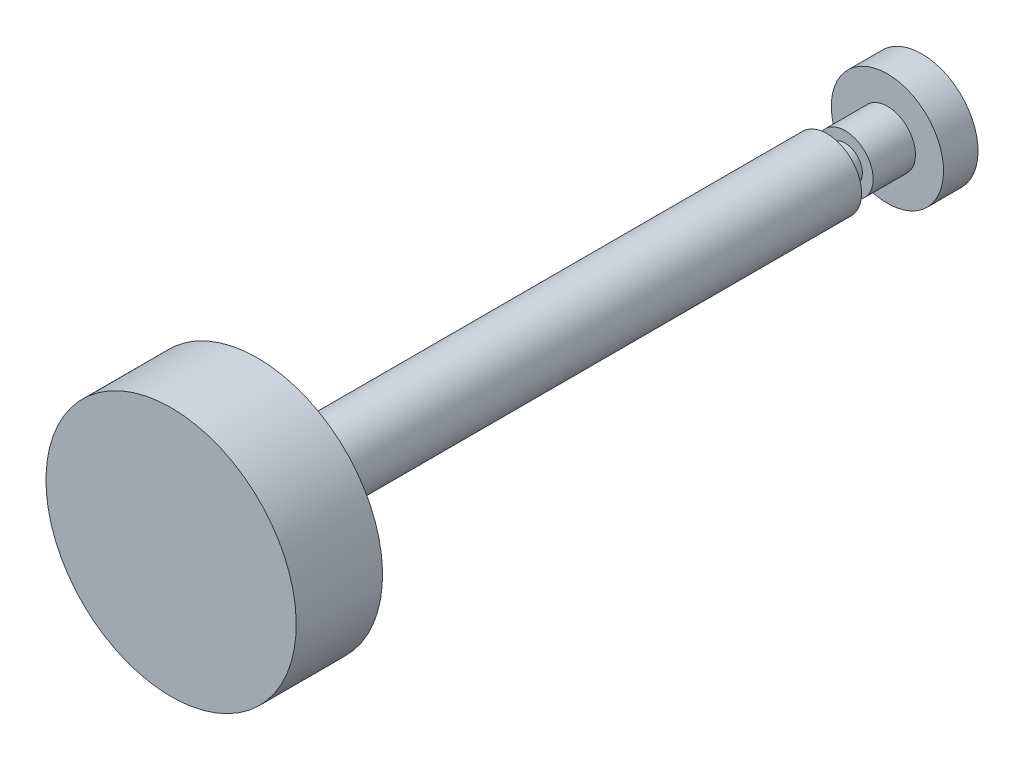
ISO-10303-21;
HEADER;
FILE_DESCRIPTION(('STEP AP214'),'2;1');
FILE_NAME('part.step','',(''),(''),'','','');
FILE_SCHEMA(('AUTOMOTIVE_DESIGN { 1 0 10303 214 1 1 1 1 }'));
ENDSEC;
DATA;
#1=APPLICATION_CONTEXT('core data for automotive mechanical design processes');
#2=APPLICATION_PROTOCOL_DEFINITION('international standard','automotive_design',2000,#1);
#3=PRODUCT_CONTEXT('',#1,'mechanical');
#4=PRODUCT('Part','Part','',(#3));
#5=PRODUCT_RELATED_PRODUCT_CATEGORY('part','',(#4));
#6=PRODUCT_DEFINITION_FORMATION('','',#4);
#7=PRODUCT_DEFINITION_CONTEXT('part definition',#1,'design');
#8=PRODUCT_DEFINITION('design','',#6,#7);
#9=PRODUCT_DEFINITION_SHAPE('','',#8);
#10=(LENGTH_UNIT() NAMED_UNIT(*) SI_UNIT(.MILLI.,.METRE.));
#11=(NAMED_UNIT(*) PLANE_ANGLE_UNIT() SI_UNIT($,.RADIAN.));
#12=(NAMED_UNIT(*) SI_UNIT($,.STERADIAN.) SOLID_ANGLE_UNIT());
#13=UNCERTAINTY_MEASURE_WITH_UNIT(LENGTH_MEASURE(1.E-05),#10,'distance_accuracy_value','');
#14=(GEOMETRIC_REPRESENTATION_CONTEXT(3) GLOBAL_UNCERTAINTY_ASSIGNED_CONTEXT((#13)) GLOBAL_UNIT_ASSIGNED_CONTEXT((#10,
#11,#12)) REPRESENTATION_CONTEXT('',''));
#15=CARTESIAN_POINT('',(0.,0.,0.));
#16=DIRECTION('',(0.,0.,1.));
#17=DIRECTION('',(1.,0.,0.));
#18=AXIS2_PLACEMENT_3D('',#15,#16,#17);
#19=CARTESIAN_POINT('',(0.,0.,0.));
#20=DIRECTION('',(0.,0.,1.));
#21=DIRECTION('',(0.,1.,0.));
#22=AXIS2_PLACEMENT_3D('',#19,#20,#21);
#23=PLANE('',#22);
#24=CARTESIAN_POINT('',(0.,0.,0.));
#25=DIRECTION('',(0.,0.,1.));
#26=DIRECTION('',(0.,1.,0.));
#27=AXIS2_PLACEMENT_3D('',#24,#25,#26);
#28=CIRCLE('',#27,6.5);
#29=CARTESIAN_POINT('',(0.,6.5,0.));
#30=VERTEX_POINT('',#29);
#31=EDGE_CURVE('E8',#30,#30,#28,.T.);
#32=ORIENTED_EDGE('',*,*,#31,.F.);
#33=EDGE_LOOP('',(#32));
#34=FACE_BOUND('',#33,.T.);
#35=ADVANCED_FACE('F12',(#34),#23,.F.);
#36=CARTESIAN_POINT('',(0.,0.,50.));
#37=DIRECTION('',(0.,0.,1.));
#38=DIRECTION('',(0.,1.,0.));
#39=AXIS2_PLACEMENT_3D('',#36,#37,#38);
#40=CYLINDRICAL_SURFACE('',#39,6.5);
#41=CARTESIAN_POINT('',(0.,0.,4.));
#42=DIRECTION('',(0.,0.,1.));
#43=DIRECTION('',(0.,1.,0.));
#44=AXIS2_PLACEMENT_3D('',#41,#42,#43);
#45=CIRCLE('',#44,6.5);
#46=CARTESIAN_POINT('',(0.,6.5,4.));
#47=VERTEX_POINT('',#46);
#48=EDGE_CURVE('E18',#47,#47,#45,.T.);
#49=ORIENTED_EDGE('',*,*,#48,.F.);
#50=EDGE_LOOP('',(#49));
#51=FACE_BOUND('',#50,.T.);
#52=ORIENTED_EDGE('',*,*,#31,.T.);
#53=EDGE_LOOP('',(#52));
#54=FACE_BOUND('',#53,.T.);
#55=ADVANCED_FACE('F71',(#51,#54),#40,.T.);
#56=CARTESIAN_POINT('',(0.,-6.5,4.));
#57=DIRECTION('',(0.,0.,-1.));
#58=DIRECTION('',(0.,-1.,0.));
#59=AXIS2_PLACEMENT_3D('',#56,#57,#58);
#60=PLANE('',#59);
#61=CARTESIAN_POINT('',(0.,0.,4.));
#62=DIRECTION('',(0.,0.,1.));
#63=DIRECTION('',(0.,1.,0.));
#64=AXIS2_PLACEMENT_3D('',#61,#62,#63);
#65=CIRCLE('',#64,3.25);
#66=CARTESIAN_POINT('',(0.,3.25,4.));
#67=VERTEX_POINT('',#66);
#68=EDGE_CURVE('E22',#67,#67,#65,.T.);
#69=ORIENTED_EDGE('',*,*,#68,.F.);
#70=EDGE_LOOP('',(#69));
#71=FACE_BOUND('',#70,.T.);
#72=ORIENTED_EDGE('',*,*,#48,.T.);
#73=EDGE_LOOP('',(#72));
#74=FACE_BOUND('',#73,.T.);
#75=ADVANCED_FACE('F76',(#71,#74),#60,.F.);
#76=CARTESIAN_POINT('',(0.,0.,50.));
#77=DIRECTION('',(0.,0.,1.));
#78=DIRECTION('',(0.,1.,0.));
#79=AXIS2_PLACEMENT_3D('',#76,#77,#78);
#80=CYLINDRICAL_SURFACE('',#79,3.25);
#81=CARTESIAN_POINT('',(0.,0.,8.9));
#82=DIRECTION('',(0.,0.,1.));
#83=DIRECTION('',(0.,1.,0.));
#84=AXIS2_PLACEMENT_3D('',#81,#82,#83);
#85=CIRCLE('',#84,3.25);
#86=CARTESIAN_POINT('',(0.,3.25,8.9));
#87=VERTEX_POINT('',#86);
#88=EDGE_CURVE('E26',#87,#87,#85,.T.);
#89=ORIENTED_EDGE('',*,*,#88,.F.);
#90=EDGE_LOOP('',(#89));
#91=FACE_BOUND('',#90,.T.);
#92=ORIENTED_EDGE('',*,*,#68,.T.);
#93=EDGE_LOOP('',(#92));
#94=FACE_BOUND('',#93,.T.);
#95=ADVANCED_FACE('F81',(#91,#94),#80,.T.);
#96=CARTESIAN_POINT('',(0.,-3.25,8.9));
#97=DIRECTION('',(0.,0.,-1.));
#98=DIRECTION('',(0.,-1.,0.));
#99=AXIS2_PLACEMENT_3D('',#96,#97,#98);
#100=PLANE('',#99);
#101=CARTESIAN_POINT('',(0.,0.,8.9));
#102=DIRECTION('',(0.,0.,1.));
#103=DIRECTION('',(0.,1.,0.));
#104=AXIS2_PLACEMENT_3D('',#101,#102,#103);
#105=CIRCLE('',#104,2.);
#106=CARTESIAN_POINT('',(0.,2.,8.9));
#107=VERTEX_POINT('',#106);
#108=EDGE_CURVE('E31',#107,#107,#105,.T.);
#109=ORIENTED_EDGE('',*,*,#108,.F.);
#110=EDGE_LOOP('',(#109));
#111=FACE_BOUND('',#110,.T.);
#112=ORIENTED_EDGE('',*,*,#88,.T.);
#113=EDGE_LOOP('',(#112));
#114=FACE_BOUND('',#113,.T.);
#115=ADVANCED_FACE('F87',(#111,#114),#100,.F.);
#116=CARTESIAN_POINT('',(0.,0.,50.));
#117=DIRECTION('',(0.,0.,1.));
#118=DIRECTION('',(0.,1.,0.));
#119=AXIS2_PLACEMENT_3D('',#116,#117,#118);
#120=CYLINDRICAL_SURFACE('',#119,2.);
#121=CARTESIAN_POINT('',(0.,0.,11.));
#122=DIRECTION('',(0.,0.,1.));
#123=DIRECTION('',(0.,1.,0.));
#124=AXIS2_PLACEMENT_3D('',#121,#122,#123);
#125=CIRCLE('',#124,2.);
#126=CARTESIAN_POINT('',(0.,2.,11.));
#127=VERTEX_POINT('',#126);
#128=EDGE_CURVE('E34',#127,#127,#125,.T.);
#129=ORIENTED_EDGE('',*,*,#128,.F.);
#130=EDGE_LOOP('',(#129));
#131=FACE_BOUND('',#130,.T.);
#132=ORIENTED_EDGE('',*,*,#108,.T.);
#133=EDGE_LOOP('',(#132));
#134=FACE_BOUND('',#133,.T.);
#135=ADVANCED_FACE('F91',(#131,#134),#120,.T.);
#136=CARTESIAN_POINT('',(0.,-2.,11.));
#137=DIRECTION('',(0.,0.,1.));
#138=DIRECTION('',(0.,1.,0.));
#139=AXIS2_PLACEMENT_3D('',#136,#137,#138);
#140=PLANE('',#139);
#141=CARTESIAN_POINT('',(0.,0.,11.));
#142=DIRECTION('',(0.,0.,1.));
#143=DIRECTION('',(0.,1.,0.));
#144=AXIS2_PLACEMENT_3D('',#141,#142,#143);
#145=CIRCLE('',#144,4.);
#146=CARTESIAN_POINT('',(0.,4.,11.));
#147=VERTEX_POINT('',#146);
#148=EDGE_CURVE('E37',#147,#147,#145,.T.);
#149=ORIENTED_EDGE('',*,*,#148,.F.);
#150=EDGE_LOOP('',(#149));
#151=FACE_BOUND('',#150,.T.);
#152=ORIENTED_EDGE('',*,*,#128,.T.);
#153=EDGE_LOOP('',(#152));
#154=FACE_BOUND('',#153,.T.);
#155=ADVANCED_FACE('F67',(#151,#154),#140,.F.);
#156=CARTESIAN_POINT('',(0.,0.,50.));
#157=DIRECTION('',(0.,0.,1.));
#158=DIRECTION('',(0.,1.,0.));
#159=AXIS2_PLACEMENT_3D('',#156,#157,#158);
#160=CYLINDRICAL_SURFACE('',#159,4.);
#161=CARTESIAN_POINT('',(0.,0.,77.));
#162=DIRECTION('',(0.,0.,1.));
#163=DIRECTION('',(0.,1.,0.));
#164=AXIS2_PLACEMENT_3D('',#161,#162,#163);
#165=CIRCLE('',#164,4.);
#166=CARTESIAN_POINT('',(0.,4.,77.));
#167=VERTEX_POINT('',#166);
#168=EDGE_CURVE('E40',#167,#167,#165,.T.);
#169=ORIENTED_EDGE('',*,*,#168,.F.);
#170=EDGE_LOOP('',(#169));
#171=FACE_BOUND('',#170,.T.);
#172=ORIENTED_EDGE('',*,*,#148,.T.);
#173=EDGE_LOOP('',(#172));
#174=FACE_BOUND('',#173,.T.);
#175=ADVANCED_FACE('F60',(#171,#174),#160,.T.);
#176=CARTESIAN_POINT('',(0.,-14.5,77.));
#177=DIRECTION('',(0.,0.,-1.));
#178=DIRECTION('',(0.,-1.,0.));
#179=AXIS2_PLACEMENT_3D('',#176,#177,#178);
#180=PLANE('',#179);
#181=ORIENTED_EDGE('',*,*,#168,.T.);
#182=EDGE_LOOP('',(#181));
#183=FACE_BOUND('',#182,.T.);
#184=CARTESIAN_POINT('',(0.,0.,77.));
#185=DIRECTION('',(0.,0.,1.));
#186=DIRECTION('',(0.,1.,0.));
#187=AXIS2_PLACEMENT_3D('',#184,#185,#186);
#188=CIRCLE('',#187,14.5);
#189=CARTESIAN_POINT('',(0.,14.5,77.));
#190=VERTEX_POINT('',#189);
#191=EDGE_CURVE('E43',#190,#190,#188,.T.);
#192=ORIENTED_EDGE('',*,*,#191,.F.);
#193=EDGE_LOOP('',(#192));
#194=FACE_BOUND('',#193,.T.);
#195=ADVANCED_FACE('F55',(#183,#194),#180,.T.);
#196=CARTESIAN_POINT('',(0.,0.,50.));
#197=DIRECTION('',(0.,0.,1.));
#198=DIRECTION('',(0.,1.,0.));
#199=AXIS2_PLACEMENT_3D('',#196,#197,#198);
#200=CYLINDRICAL_SURFACE('',#199,14.5);
#201=CARTESIAN_POINT('',(0.,0.,87.));
#202=DIRECTION('',(0.,0.,1.));
#203=DIRECTION('',(0.,1.,0.));
#204=AXIS2_PLACEMENT_3D('',#201,#202,#203);
#205=CIRCLE('',#204,14.5);
#206=CARTESIAN_POINT('',(0.,14.5,87.));
#207=VERTEX_POINT('',#206);
#208=EDGE_CURVE('E46',#207,#207,#205,.T.);
#209=ORIENTED_EDGE('',*,*,#208,.F.);
#210=EDGE_LOOP('',(#209));
#211=FACE_BOUND('',#210,.T.);
#212=ORIENTED_EDGE('',*,*,#191,.T.);
#213=EDGE_LOOP('',(#212));
#214=FACE_BOUND('',#213,.T.);
#215=ADVANCED_FACE('F52',(#211,#214),#200,.T.);
#216=CARTESIAN_POINT('',(0.,-14.5,87.));
#217=DIRECTION('',(0.,0.,-1.));
#218=DIRECTION('',(0.,-1.,0.));
#219=AXIS2_PLACEMENT_3D('',#216,#217,#218);
#220=PLANE('',#219);
#221=ORIENTED_EDGE('',*,*,#208,.T.);
#222=EDGE_LOOP('',(#221));
#223=FACE_BOUND('',#222,.T.);
#224=ADVANCED_FACE('F50',(#223),#220,.F.);
#225=CLOSED_SHELL('',(#35,#55,#75,#95,#115,#135,#155,#175,#195,#215,#224));
#226=MANIFOLD_SOLID_BREP('B1',#225);
#227=ADVANCED_BREP_SHAPE_REPRESENTATION('',(#18,#226),#14);
#228=SHAPE_DEFINITION_REPRESENTATION(#9,#227);
ENDSEC;
END-ISO-10303-21;
